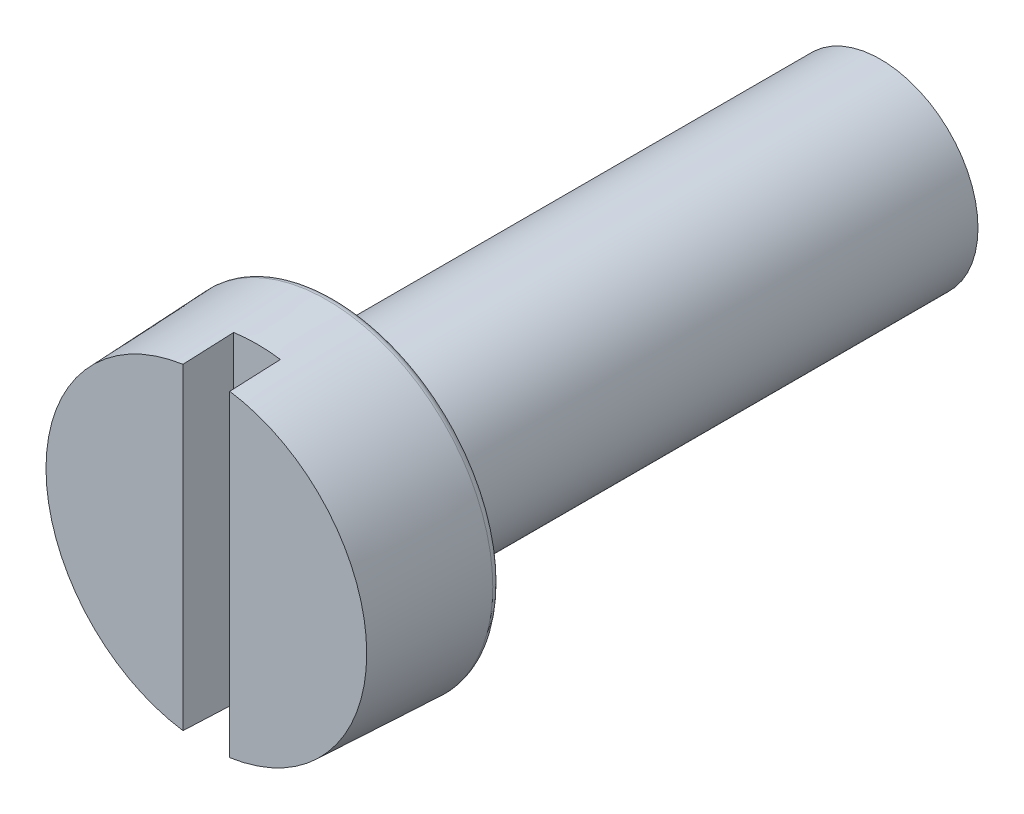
ISO-10303-21;
HEADER;
FILE_DESCRIPTION(('STEP AP214'),'2;1');
FILE_NAME('part.step','',(''),(''),'','','');
FILE_SCHEMA(('AUTOMOTIVE_DESIGN { 1 0 10303 214 1 1 1 1 }'));
ENDSEC;
DATA;
#1=APPLICATION_CONTEXT('core data for automotive mechanical design processes');
#2=APPLICATION_PROTOCOL_DEFINITION('international standard','automotive_design',2000,#1);
#3=PRODUCT_CONTEXT('',#1,'mechanical');
#4=PRODUCT('Part','Part','',(#3));
#5=PRODUCT_RELATED_PRODUCT_CATEGORY('part','',(#4));
#6=PRODUCT_DEFINITION_FORMATION('','',#4);
#7=PRODUCT_DEFINITION_CONTEXT('part definition',#1,'design');
#8=PRODUCT_DEFINITION('design','',#6,#7);
#9=PRODUCT_DEFINITION_SHAPE('','',#8);
#10=(LENGTH_UNIT() NAMED_UNIT(*) SI_UNIT(.MILLI.,.METRE.));
#11=(NAMED_UNIT(*) PLANE_ANGLE_UNIT() SI_UNIT($,.RADIAN.));
#12=(NAMED_UNIT(*) SI_UNIT($,.STERADIAN.) SOLID_ANGLE_UNIT());
#13=UNCERTAINTY_MEASURE_WITH_UNIT(LENGTH_MEASURE(1.E-05),#10,'distance_accuracy_value','');
#14=(GEOMETRIC_REPRESENTATION_CONTEXT(3) GLOBAL_UNCERTAINTY_ASSIGNED_CONTEXT((#13)) GLOBAL_UNIT_ASSIGNED_CONTEXT((#10,
#11,#12)) REPRESENTATION_CONTEXT('',''));
#15=CARTESIAN_POINT('',(0.,0.,0.));
#16=DIRECTION('',(0.,0.,1.));
#17=DIRECTION('',(1.,0.,0.));
#18=AXIS2_PLACEMENT_3D('',#15,#16,#17);
#19=CARTESIAN_POINT('',(0.,0.,3.3));
#20=DIRECTION('',(0.,0.,1.));
#21=DIRECTION('',(1.,0.,0.));
#22=AXIS2_PLACEMENT_3D('',#19,#20,#21);
#23=PLANE('',#22);
#24=DIRECTION('',(0.,1.,0.));
#25=VECTOR('',#24,1.);
#26=CARTESIAN_POINT('',(0.6,0.,3.3));
#27=LINE('',#26,#25);
#28=CARTESIAN_POINT('',(0.6,-4.07066990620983,3.3));
#29=VERTEX_POINT('',#28);
#30=CARTESIAN_POINT('',(0.6,4.07066990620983,3.3));
#31=VERTEX_POINT('',#30);
#32=EDGE_CURVE('E40',#29,#31,#27,.T.);
#33=ORIENTED_EDGE('',*,*,#32,.F.);
#34=CARTESIAN_POINT('',(0.,0.,3.3));
#35=DIRECTION('',(0.,0.,1.));
#36=DIRECTION('',(1.,0.,0.));
#37=AXIS2_PLACEMENT_3D('',#34,#35,#36);
#38=CIRCLE('',#37,4.11465107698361);
#39=EDGE_CURVE('E119',#29,#31,#38,.T.);
#40=ORIENTED_EDGE('',*,*,#39,.T.);
#41=EDGE_LOOP('',(#33,#40));
#42=FACE_BOUND('',#41,.T.);
#43=ADVANCED_FACE('F12',(#42),#23,.T.);
#44=DIRECTION('',(0.,-1.,0.));
#45=VECTOR('',#44,1.);
#46=CARTESIAN_POINT('',(-0.6,0.,3.3));
#47=LINE('',#46,#45);
#48=CARTESIAN_POINT('',(-0.6,4.07066990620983,3.3));
#49=VERTEX_POINT('',#48);
#50=CARTESIAN_POINT('',(-0.6,-4.07066990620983,3.3));
#51=VERTEX_POINT('',#50);
#52=EDGE_CURVE('E71',#49,#51,#47,.T.);
#53=ORIENTED_EDGE('',*,*,#52,.F.);
#54=EDGE_CURVE('E77',#49,#51,#38,.T.);
#55=ORIENTED_EDGE('',*,*,#54,.T.);
#56=EDGE_LOOP('',(#53,#55));
#57=FACE_BOUND('',#56,.T.);
#58=ADVANCED_FACE('F14',(#57),#23,.T.);
#59=CARTESIAN_POINT('',(0.,0.,-14.));
#60=DIRECTION('',(0.,0.,1.));
#61=DIRECTION('',(1.,0.,0.));
#62=AXIS2_PLACEMENT_3D('',#59,#60,#61);
#63=PLANE('',#62);
#64=CARTESIAN_POINT('',(0.,0.,-14.));
#65=DIRECTION('',(0.,0.,1.));
#66=DIRECTION('',(1.,0.,0.));
#67=AXIS2_PLACEMENT_3D('',#64,#65,#66);
#68=CIRCLE('',#67,2.5);
#69=CARTESIAN_POINT('',(2.5,0.,-14.));
#70=VERTEX_POINT('',#69);
#71=EDGE_CURVE('E98',#70,#70,#68,.T.);
#72=ORIENTED_EDGE('',*,*,#71,.F.);
#73=EDGE_LOOP('',(#72));
#74=FACE_BOUND('',#73,.T.);
#75=ADVANCED_FACE('F127',(#74),#63,.F.);
#76=CARTESIAN_POINT('',(0.,0.,0.));
#77=DIRECTION('',(0.,0.,1.));
#78=DIRECTION('',(1.,0.,0.));
#79=AXIS2_PLACEMENT_3D('',#76,#77,#78);
#80=CYLINDRICAL_SURFACE('',#79,2.5);
#81=CARTESIAN_POINT('',(0.,0.,-0.433));
#82=DIRECTION('',(0.,0.,1.));
#83=DIRECTION('',(1.,0.,0.));
#84=AXIS2_PLACEMENT_3D('',#81,#82,#83);
#85=CIRCLE('',#84,2.5);
#86=CARTESIAN_POINT('',(2.5,0.,-0.433));
#87=VERTEX_POINT('',#86);
#88=EDGE_CURVE('E101',#87,#87,#85,.T.);
#89=ORIENTED_EDGE('',*,*,#88,.F.);
#90=EDGE_LOOP('',(#89));
#91=FACE_BOUND('',#90,.T.);
#92=ORIENTED_EDGE('',*,*,#71,.T.);
#93=EDGE_LOOP('',(#92));
#94=FACE_BOUND('',#93,.T.);
#95=ADVANCED_FACE('F131',(#91,#94),#80,.T.);
#96=CARTESIAN_POINT('',(0.,0.,-0.433));
#97=DIRECTION('',(0.,0.,1.));
#98=DIRECTION('',(1.,0.,0.));
#99=AXIS2_PLACEMENT_3D('',#96,#97,#98);
#100=TOROIDAL_SURFACE('',#99,2.7,0.2);
#101=ORIENTED_EDGE('',*,*,#88,.T.);
#102=EDGE_LOOP('',(#101));
#103=FACE_BOUND('',#102,.T.);
#104=CARTESIAN_POINT('',(0.,0.,-0.324739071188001));
#105=DIRECTION('',(0.,0.,1.));
#106=DIRECTION('',(1.,0.,0.));
#107=AXIS2_PLACEMENT_3D('',#104,#105,#106);
#108=CIRCLE('',#107,2.5318346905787);
#109=CARTESIAN_POINT('',(2.5318346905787,0.,-0.324739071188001));
#110=VERTEX_POINT('',#109);
#111=EDGE_CURVE('E104',#110,#110,#108,.T.);
#112=ORIENTED_EDGE('',*,*,#111,.F.);
#113=EDGE_LOOP('',(#112));
#114=FACE_BOUND('',#113,.T.);
#115=ADVANCED_FACE('F161',(#103,#114),#100,.F.);
#116=CARTESIAN_POINT('',(0.,0.,-0.324739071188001));
#117=DIRECTION('',(0.,0.,1.));
#118=DIRECTION('',(1.,0.,0.));
#119=AXIS2_PLACEMENT_3D('',#116,#117,#118);
#120=CONICAL_SURFACE('',#119,2.5318346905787,0.571987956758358);
#121=CARTESIAN_POINT('',(0.,0.,-0.0917390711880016));
#122=DIRECTION('',(0.,0.,1.));
#123=DIRECTION('',(1.,0.,0.));
#124=AXIS2_PLACEMENT_3D('',#121,#122,#123);
#125=CIRCLE('',#124,2.68183469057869);
#126=CARTESIAN_POINT('',(2.68183469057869,0.,-0.0917390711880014));
#127=VERTEX_POINT('',#126);
#128=EDGE_CURVE('E107',#127,#127,#125,.T.);
#129=ORIENTED_EDGE('',*,*,#128,.F.);
#130=EDGE_LOOP('',(#129));
#131=FACE_BOUND('',#130,.T.);
#132=ORIENTED_EDGE('',*,*,#111,.T.);
#133=EDGE_LOOP('',(#132));
#134=FACE_BOUND('',#133,.T.);
#135=ADVANCED_FACE('F157',(#131,#134),#120,.T.);
#136=CARTESIAN_POINT('',(0.,0.,-0.2));
#137=DIRECTION('',(0.,0.,1.));
#138=DIRECTION('',(1.,0.,0.));
#139=AXIS2_PLACEMENT_3D('',#136,#137,#138);
#140=TOROIDAL_SURFACE('',#139,2.85,0.2);
#141=ORIENTED_EDGE('',*,*,#128,.T.);
#142=EDGE_LOOP('',(#141));
#143=FACE_BOUND('',#142,.T.);
#144=CARTESIAN_POINT('',(0.,0.,0.));
#145=DIRECTION('',(0.,0.,1.));
#146=DIRECTION('',(1.,0.,0.));
#147=AXIS2_PLACEMENT_3D('',#144,#145,#146);
#148=CIRCLE('',#147,2.85);
#149=CARTESIAN_POINT('',(2.85,0.,0.));
#150=VERTEX_POINT('',#149);
#151=EDGE_CURVE('E110',#150,#150,#148,.T.);
#152=ORIENTED_EDGE('',*,*,#151,.F.);
#153=EDGE_LOOP('',(#152));
#154=FACE_BOUND('',#153,.T.);
#155=ADVANCED_FACE('F149',(#143,#154),#140,.F.);
#156=CARTESIAN_POINT('',(0.,2.85,0.));
#157=DIRECTION('',(0.,0.,1.));
#158=DIRECTION('',(1.,0.,0.));
#159=AXIS2_PLACEMENT_3D('',#156,#157,#158);
#160=PLANE('',#159);
#161=CARTESIAN_POINT('',(0.,0.,0.));
#162=DIRECTION('',(0.,0.,1.));
#163=DIRECTION('',(1.,0.,0.));
#164=AXIS2_PLACEMENT_3D('',#161,#162,#163);
#165=CIRCLE('',#164,4.05);
#166=CARTESIAN_POINT('',(4.05,0.,0.));
#167=VERTEX_POINT('',#166);
#168=EDGE_CURVE('E113',#167,#167,#165,.T.);
#169=ORIENTED_EDGE('',*,*,#168,.F.);
#170=EDGE_LOOP('',(#169));
#171=FACE_BOUND('',#170,.T.);
#172=ORIENTED_EDGE('',*,*,#151,.T.);
#173=EDGE_LOOP('',(#172));
#174=FACE_BOUND('',#173,.T.);
#175=ADVANCED_FACE('F145',(#171,#174),#160,.F.);
#176=CARTESIAN_POINT('',(0.,0.,0.2));
#177=DIRECTION('',(0.,0.,1.));
#178=DIRECTION('',(1.,0.,0.));
#179=AXIS2_PLACEMENT_3D('',#176,#177,#178);
#180=TOROIDAL_SURFACE('',#179,4.05,0.2);
#181=CARTESIAN_POINT('',(0.,0.,0.2));
#182=DIRECTION('',(0.,0.,1.));
#183=DIRECTION('',(1.,0.,0.));
#184=AXIS2_PLACEMENT_3D('',#181,#182,#183);
#185=CIRCLE('',#184,4.25);
#186=CARTESIAN_POINT('',(4.25,0.,0.2));
#187=VERTEX_POINT('',#186);
#188=EDGE_CURVE('E116',#187,#187,#185,.T.);
#189=ORIENTED_EDGE('',*,*,#188,.F.);
#190=EDGE_LOOP('',(#189));
#191=FACE_BOUND('',#190,.T.);
#192=ORIENTED_EDGE('',*,*,#168,.T.);
#193=EDGE_LOOP('',(#192));
#194=FACE_BOUND('',#193,.T.);
#195=ADVANCED_FACE('F140',(#191,#194),#180,.T.);
#196=CARTESIAN_POINT('',(0.,0.,0.2));
#197=DIRECTION('',(0.,0.,-1.));
#198=DIRECTION('',(-1.,0.,0.));
#199=AXIS2_PLACEMENT_3D('',#196,#197,#198);
#200=CONICAL_SURFACE('',#199,4.25,0.0436332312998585);
#201=CARTESIAN_POINT('',(0.,0.,2.));
#202=DIRECTION('',(0.,0.,-1.));
#203=DIRECTION('',(-1.,0.,0.));
#204=AXIS2_PLACEMENT_3D('',#201,#202,#203);
#205=CIRCLE('',#204,4.17141030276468);
#206=CARTESIAN_POINT('',(-0.6,4.12803390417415,2.));
#207=VERTEX_POINT('',#206);
#208=CARTESIAN_POINT('',(0.6,4.12803390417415,2.));
#209=VERTEX_POINT('',#208);
#210=EDGE_CURVE('E56',#207,#209,#205,.T.);
#211=ORIENTED_EDGE('',*,*,#210,.T.);
#212=CARTESIAN_POINT('',(0.6,4.44714534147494,-5.23822909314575));
#213=CARTESIAN_POINT('',(0.6,4.33072542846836,-2.59534104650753));
#214=CARTESIAN_POINT('',(0.6,4.21420043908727,0.0475423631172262));
#215=CARTESIAN_POINT('',(0.6,3.9809403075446,5.33329990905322));
#216=CARTESIAN_POINT('',(0.6,3.86420516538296,7.97617404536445));
#217=CARTESIAN_POINT('',(0.6,3.74736494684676,10.6190435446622));
#218=B_SPLINE_CURVE_WITH_KNOTS('',3,(#212,#213,#214,#215,#216,#217),.UNSPECIFIED.,.F.,.F.,(4,2,
4),(0.,7.93635288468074,15.8727057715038),.UNSPECIFIED.);
#219=EDGE_CURVE('E9',#209,#31,#218,.T.);
#220=ORIENTED_EDGE('',*,*,#219,.T.);
#221=ORIENTED_EDGE('',*,*,#39,.F.);
#222=CARTESIAN_POINT('',(0.6,-3.74736494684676,10.6190435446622));
#223=CARTESIAN_POINT('',(0.6,-3.86420516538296,7.97617404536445));
#224=CARTESIAN_POINT('',(0.6,-3.9809403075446,5.33329990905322));
#225=CARTESIAN_POINT('',(0.6,-4.21420043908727,0.0475423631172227));
#226=CARTESIAN_POINT('',(0.6,-4.33072542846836,-2.59534104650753));
#227=CARTESIAN_POINT('',(0.6,-4.44714534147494,-5.23822909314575));
#228=B_SPLINE_CURVE_WITH_KNOTS('',3,(#222,#223,#224,#225,#226,#227),.UNSPECIFIED.,.F.,.F.,(4,2,
4),(0.,7.9363528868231,15.8727057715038),.UNSPECIFIED.);
#229=CARTESIAN_POINT('',(0.6,-4.12803390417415,2.));
#230=VERTEX_POINT('',#229);
#231=EDGE_CURVE('E62',#29,#230,#228,.T.);
#232=ORIENTED_EDGE('',*,*,#231,.T.);
#233=CARTESIAN_POINT('',(-0.6,-4.12803390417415,2.));
#234=VERTEX_POINT('',#233);
#235=EDGE_CURVE('E64',#230,#234,#205,.T.);
#236=ORIENTED_EDGE('',*,*,#235,.T.);
#237=CARTESIAN_POINT('',(-0.6,-4.44714534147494,-5.23822909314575));
#238=CARTESIAN_POINT('',(-0.6,-4.33072542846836,-2.59534104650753));
#239=CARTESIAN_POINT('',(-0.6,-4.21420043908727,0.0475423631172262));
#240=CARTESIAN_POINT('',(-0.6,-3.9809403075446,5.33329990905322));
#241=CARTESIAN_POINT('',(-0.6,-3.86420516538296,7.97617404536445));
#242=CARTESIAN_POINT('',(-0.6,-3.74736494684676,10.6190435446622));
#243=B_SPLINE_CURVE_WITH_KNOTS('',3,(#237,#238,#239,#240,#241,#242),.UNSPECIFIED.,.F.,.F.,(4,2,
4),(0.,7.93635288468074,15.8727057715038),.UNSPECIFIED.);
#244=EDGE_CURVE('E69',#234,#51,#243,.T.);
#245=ORIENTED_EDGE('',*,*,#244,.T.);
#246=ORIENTED_EDGE('',*,*,#54,.F.);
#247=CARTESIAN_POINT('',(-0.6,3.74736494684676,10.6190435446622));
#248=CARTESIAN_POINT('',(-0.6,3.86420516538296,7.97617404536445));
#249=CARTESIAN_POINT('',(-0.6,3.9809403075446,5.33329990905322));
#250=CARTESIAN_POINT('',(-0.6,4.21420043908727,0.0475423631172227));
#251=CARTESIAN_POINT('',(-0.6,4.33072542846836,-2.59534104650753));
#252=CARTESIAN_POINT('',(-0.6,4.44714534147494,-5.23822909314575));
#253=B_SPLINE_CURVE_WITH_KNOTS('',3,(#247,#248,#249,#250,#251,#252),.UNSPECIFIED.,.F.,.F.,(4,2,
4),(0.,7.9363528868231,15.8727057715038),.UNSPECIFIED.);
#254=EDGE_CURVE('E25',#49,#207,#253,.T.);
#255=ORIENTED_EDGE('',*,*,#254,.T.);
#256=EDGE_LOOP('',(#211,#220,#221,#232,#236,#245,#246,#255));
#257=FACE_BOUND('',#256,.T.);
#258=ORIENTED_EDGE('',*,*,#188,.T.);
#259=EDGE_LOOP('',(#258));
#260=FACE_BOUND('',#259,.T.);
#261=ADVANCED_FACE('F74',(#257,#260),#200,.T.);
#262=CARTESIAN_POINT('',(0.6,0.,2.65));
#263=DIRECTION('',(1.,0.,0.));
#264=DIRECTION('',(0.,0.,-1.));
#265=AXIS2_PLACEMENT_3D('',#262,#263,#264);
#266=PLANE('',#265);
#267=ORIENTED_EDGE('',*,*,#32,.T.);
#268=ORIENTED_EDGE('',*,*,#219,.F.);
#269=DIRECTION('',(0.,-1.,0.));
#270=VECTOR('',#269,1.);
#271=CARTESIAN_POINT('',(0.6,0.,2.));
#272=LINE('',#271,#270);
#273=EDGE_CURVE('E59',#209,#230,#272,.T.);
#274=ORIENTED_EDGE('',*,*,#273,.T.);
#275=ORIENTED_EDGE('',*,*,#231,.F.);
#276=EDGE_LOOP('',(#267,#268,#274,#275));
#277=FACE_BOUND('',#276,.T.);
#278=ADVANCED_FACE('F92',(#277),#266,.F.);
#279=CARTESIAN_POINT('',(-0.6,0.,2.65));
#280=DIRECTION('',(-1.,0.,0.));
#281=DIRECTION('',(0.,0.,1.));
#282=AXIS2_PLACEMENT_3D('',#279,#280,#281);
#283=PLANE('',#282);
#284=DIRECTION('',(0.,1.,0.));
#285=VECTOR('',#284,1.);
#286=CARTESIAN_POINT('',(-0.6,0.,2.));
#287=LINE('',#286,#285);
#288=EDGE_CURVE('E32',#234,#207,#287,.T.);
#289=ORIENTED_EDGE('',*,*,#288,.T.);
#290=ORIENTED_EDGE('',*,*,#254,.F.);
#291=ORIENTED_EDGE('',*,*,#52,.T.);
#292=ORIENTED_EDGE('',*,*,#244,.F.);
#293=EDGE_LOOP('',(#289,#290,#291,#292));
#294=FACE_BOUND('',#293,.T.);
#295=ADVANCED_FACE('F66',(#294),#283,.F.);
#296=CARTESIAN_POINT('',(-0.6,0.,2.));
#297=DIRECTION('',(0.,0.,-1.));
#298=DIRECTION('',(-1.,0.,0.));
#299=AXIS2_PLACEMENT_3D('',#296,#297,#298);
#300=PLANE('',#299);
#301=ORIENTED_EDGE('',*,*,#288,.F.);
#302=ORIENTED_EDGE('',*,*,#235,.F.);
#303=ORIENTED_EDGE('',*,*,#273,.F.);
#304=ORIENTED_EDGE('',*,*,#210,.F.);
#305=EDGE_LOOP('',(#301,#302,#303,#304));
#306=FACE_BOUND('',#305,.T.);
#307=ADVANCED_FACE('F57',(#306),#300,.F.);
#308=CLOSED_SHELL('',(#43,#58,#75,#95,#115,#135,#155,#175,#195,#261,#278,#295,#307));
#309=MANIFOLD_SOLID_BREP('B1',#308);
#310=ADVANCED_BREP_SHAPE_REPRESENTATION('',(#18,#309),#14);
#311=SHAPE_DEFINITION_REPRESENTATION(#9,#310);
ENDSEC;
END-ISO-10303-21;
